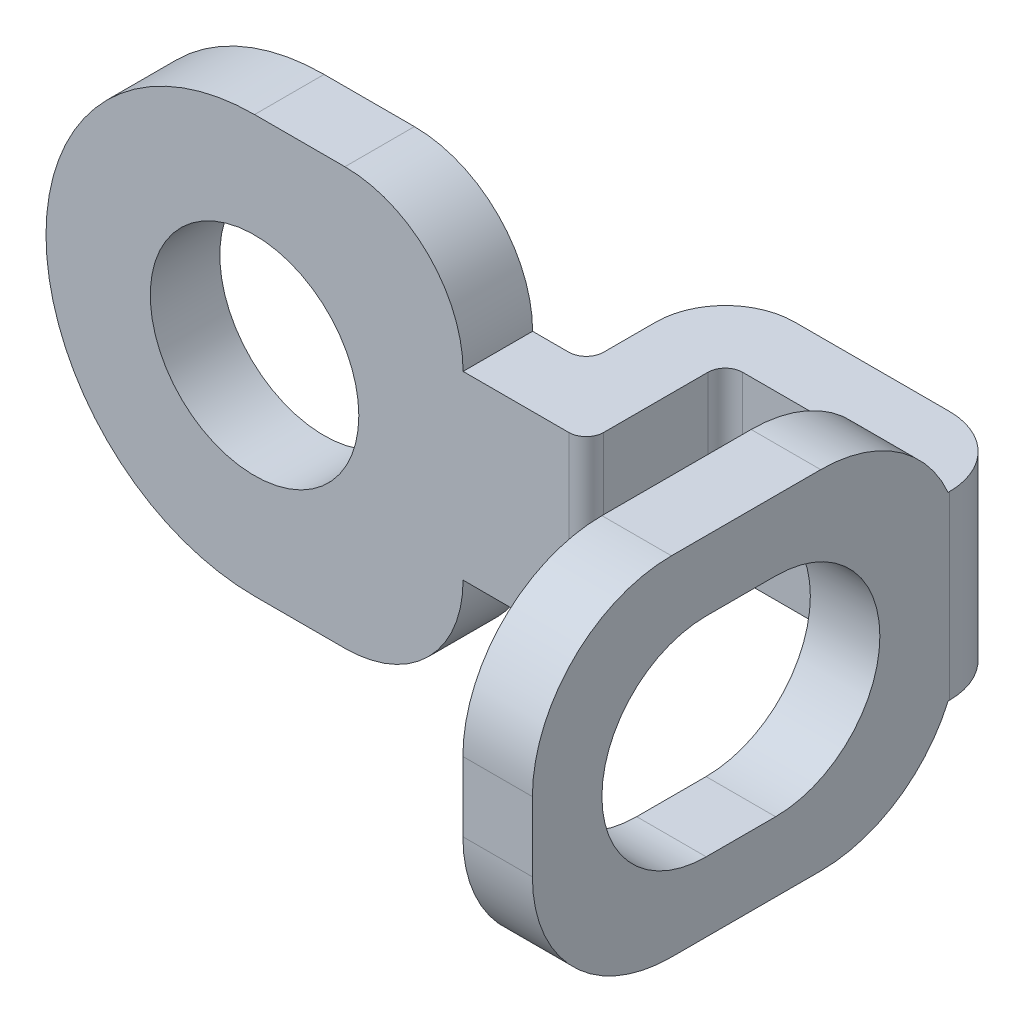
ISO-10303-21;
HEADER;
FILE_DESCRIPTION(('STEP AP214'),'2;1');
FILE_NAME('part.step','',(''),(''),'','','');
FILE_SCHEMA(('AUTOMOTIVE_DESIGN { 1 0 10303 214 1 1 1 1 }'));
ENDSEC;
DATA;
#1=APPLICATION_CONTEXT('core data for automotive mechanical design processes');
#2=APPLICATION_PROTOCOL_DEFINITION('international standard','automotive_design',2000,#1);
#3=PRODUCT_CONTEXT('',#1,'mechanical');
#4=PRODUCT('Part','Part','',(#3));
#5=PRODUCT_RELATED_PRODUCT_CATEGORY('part','',(#4));
#6=PRODUCT_DEFINITION_FORMATION('','',#4);
#7=PRODUCT_DEFINITION_CONTEXT('part definition',#1,'design');
#8=PRODUCT_DEFINITION('design','',#6,#7);
#9=PRODUCT_DEFINITION_SHAPE('','',#8);
#10=(LENGTH_UNIT() NAMED_UNIT(*) SI_UNIT(.MILLI.,.METRE.));
#11=(NAMED_UNIT(*) PLANE_ANGLE_UNIT() SI_UNIT($,.RADIAN.));
#12=(NAMED_UNIT(*) SI_UNIT($,.STERADIAN.) SOLID_ANGLE_UNIT());
#13=UNCERTAINTY_MEASURE_WITH_UNIT(LENGTH_MEASURE(1.E-05),#10,'distance_accuracy_value','');
#14=(GEOMETRIC_REPRESENTATION_CONTEXT(3) GLOBAL_UNCERTAINTY_ASSIGNED_CONTEXT((#13)) GLOBAL_UNIT_ASSIGNED_CONTEXT((#10,
#11,#12)) REPRESENTATION_CONTEXT('',''));
#15=CARTESIAN_POINT('',(0.,0.,0.));
#16=DIRECTION('',(0.,0.,1.));
#17=DIRECTION('',(1.,0.,0.));
#18=AXIS2_PLACEMENT_3D('',#15,#16,#17);
#19=CARTESIAN_POINT('',(4.1409794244,1.0795,-0.15875));
#20=DIRECTION('',(0.,1.,0.));
#21=DIRECTION('',(-1.,0.,0.));
#22=AXIS2_PLACEMENT_3D('',#19,#20,#21);
#23=CYLINDRICAL_SURFACE('',#22,0.15875);
#24=CARTESIAN_POINT('',(4.1409794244,2.7305,-0.15875));
#25=DIRECTION('',(0.,1.,0.));
#26=DIRECTION('',(-1.,0.,0.));
#27=AXIS2_PLACEMENT_3D('',#24,#25,#26);
#28=CIRCLE('',#27,0.15875);
#29=CARTESIAN_POINT('',(4.1409794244,2.730500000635,0.));
#30=VERTEX_POINT('',#29);
#31=CARTESIAN_POINT('',(4.2997294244,2.7305,-0.15875));
#32=VERTEX_POINT('',#31);
#33=EDGE_CURVE('E220',#30,#32,#28,.T.);
#34=ORIENTED_EDGE('',*,*,#33,.T.);
#35=DIRECTION('',(0.,-1.,0.));
#36=VECTOR('',#35,1.);
#37=CARTESIAN_POINT('',(4.2997294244,1.905,-0.15875));
#38=LINE('',#37,#36);
#39=CARTESIAN_POINT('',(4.2997294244,1.0795,-0.15875));
#40=VERTEX_POINT('',#39);
#41=EDGE_CURVE('E224',#32,#40,#38,.T.);
#42=ORIENTED_EDGE('',*,*,#41,.T.);
#43=CARTESIAN_POINT('',(4.1409794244,1.0795,-0.15875));
#44=DIRECTION('',(0.,1.,0.));
#45=DIRECTION('',(-1.,0.,0.));
#46=AXIS2_PLACEMENT_3D('',#43,#44,#45);
#47=CIRCLE('',#46,0.15875);
#48=CARTESIAN_POINT('',(4.1409794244,1.079499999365,0.));
#49=VERTEX_POINT('',#48);
#50=EDGE_CURVE('E19',#40,#49,#47,.F.);
#51=ORIENTED_EDGE('',*,*,#50,.T.);
#52=DIRECTION('',(0.,-1.,0.));
#53=VECTOR('',#52,1.);
#54=CARTESIAN_POINT('',(4.1409794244,1.905,0.));
#55=LINE('',#54,#53);
#56=EDGE_CURVE('E239',#30,#49,#55,.T.);
#57=ORIENTED_EDGE('',*,*,#56,.F.);
#58=EDGE_LOOP('',(#34,#42,#51,#57));
#59=FACE_BOUND('',#58,.T.);
#60=ADVANCED_FACE('F15',(#59),#23,.F.);
#61=CARTESIAN_POINT('',(4.1409794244,0.,0.));
#62=DIRECTION('',(0.,0.,-1.));
#63=DIRECTION('',(-1.,0.,0.));
#64=AXIS2_PLACEMENT_3D('',#61,#62,#63);
#65=PLANE('',#64);
#66=CARTESIAN_POINT('',(1.905,1.905,0.));
#67=DIRECTION('',(0.,0.,1.));
#68=DIRECTION('',(1.,0.,0.));
#69=AXIS2_PLACEMENT_3D('',#66,#67,#68);
#70=CIRCLE('',#69,0.9525);
#71=CARTESIAN_POINT('',(2.8575,1.905,0.));
#72=VERTEX_POINT('',#71);
#73=EDGE_CURVE('E504',#72,#72,#70,.F.);
#74=ORIENTED_EDGE('',*,*,#73,.F.);
#75=EDGE_LOOP('',(#74));
#76=FACE_BOUND('',#75,.T.);
#77=DIRECTION('',(1.,0.,0.));
#78=VECTOR('',#77,1.);
#79=CARTESIAN_POINT('',(2.31775,3.81,0.));
#80=LINE('',#79,#78);
#81=CARTESIAN_POINT('',(1.905,3.81,0.));
#82=VERTEX_POINT('',#81);
#83=CARTESIAN_POINT('',(2.7305000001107,3.81,0.));
#84=VERTEX_POINT('',#83);
#85=EDGE_CURVE('E509',#82,#84,#80,.T.);
#86=ORIENTED_EDGE('',*,*,#85,.T.);
#87=CARTESIAN_POINT('',(2.7305,2.7305,0.));
#88=DIRECTION('',(0.,0.,-1.));
#89=DIRECTION('',(-1.,0.,0.));
#90=AXIS2_PLACEMENT_3D('',#87,#88,#89);
#91=CIRCLE('',#90,1.0795);
#92=CARTESIAN_POINT('',(3.81,2.73050000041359,0.));
#93=VERTEX_POINT('',#92);
#94=EDGE_CURVE('E505',#84,#93,#91,.T.);
#95=ORIENTED_EDGE('',*,*,#94,.T.);
#96=DIRECTION('',(1.,0.,0.));
#97=VECTOR('',#96,1.);
#98=CARTESIAN_POINT('',(2.0580667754,2.73050000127,0.));
#99=LINE('',#98,#97);
#100=EDGE_CURVE('E241',#93,#30,#99,.T.);
#101=ORIENTED_EDGE('',*,*,#100,.T.);
#102=ORIENTED_EDGE('',*,*,#56,.T.);
#103=DIRECTION('',(-1.,0.,0.));
#104=VECTOR('',#103,1.);
#105=CARTESIAN_POINT('',(2.0580667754,1.07949999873,0.));
#106=LINE('',#105,#104);
#107=CARTESIAN_POINT('',(3.81,1.07949999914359,0.));
#108=VERTEX_POINT('',#107);
#109=EDGE_CURVE('E215',#49,#108,#106,.T.);
#110=ORIENTED_EDGE('',*,*,#109,.T.);
#111=CARTESIAN_POINT('',(2.7305,1.0795,0.));
#112=DIRECTION('',(0.,0.,-1.));
#113=DIRECTION('',(-1.,0.,0.));
#114=AXIS2_PLACEMENT_3D('',#111,#112,#113);
#115=CIRCLE('',#114,1.0795);
#116=CARTESIAN_POINT('',(2.7305,0.,0.));
#117=VERTEX_POINT('',#116);
#118=EDGE_CURVE('E520',#108,#117,#115,.T.);
#119=ORIENTED_EDGE('',*,*,#118,.T.);
#120=DIRECTION('',(-1.,0.,0.));
#121=VECTOR('',#120,1.);
#122=CARTESIAN_POINT('',(2.31775,0.,0.));
#123=LINE('',#122,#121);
#124=CARTESIAN_POINT('',(1.90500000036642,0.,0.));
#125=VERTEX_POINT('',#124);
#126=EDGE_CURVE('E237',#117,#125,#123,.T.);
#127=ORIENTED_EDGE('',*,*,#126,.T.);
#128=CARTESIAN_POINT('',(1.905,1.905,0.));
#129=DIRECTION('',(0.,0.,-1.));
#130=DIRECTION('',(-1.,0.,0.));
#131=AXIS2_PLACEMENT_3D('',#128,#129,#130);
#132=CIRCLE('',#131,1.905);
#133=EDGE_CURVE('E513',#125,#82,#132,.T.);
#134=ORIENTED_EDGE('',*,*,#133,.T.);
#135=EDGE_LOOP('',(#86,#95,#101,#102,#110,#119,#127,#134));
#136=FACE_BOUND('',#135,.T.);
#137=ADVANCED_FACE('F377',(#76,#136),#65,.T.);
#138=CARTESIAN_POINT('',(4.2997294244,1.0795,-0.15875));
#139=DIRECTION('',(1.,0.,0.));
#140=DIRECTION('',(0.,0.,-1.));
#141=AXIS2_PLACEMENT_3D('',#138,#139,#140);
#142=PLANE('',#141);
#143=ORIENTED_EDGE('',*,*,#41,.F.);
#144=DIRECTION('',(0.,0.,1.));
#145=VECTOR('',#144,1.);
#146=CARTESIAN_POINT('',(4.2997294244,2.7305,-0.396875));
#147=LINE('',#146,#145);
#148=CARTESIAN_POINT('',(4.2997294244,2.7305,-0.635000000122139));
#149=VERTEX_POINT('',#148);
#150=EDGE_CURVE('E232',#149,#32,#147,.T.);
#151=ORIENTED_EDGE('',*,*,#150,.F.);
#152=DIRECTION('',(0.,1.,0.));
#153=VECTOR('',#152,1.);
#154=CARTESIAN_POINT('',(4.2997294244,1.905,-0.635000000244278));
#155=LINE('',#154,#153);
#156=CARTESIAN_POINT('',(4.2997294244,1.0795,-0.635000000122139));
#157=VERTEX_POINT('',#156);
#158=EDGE_CURVE('E227',#149,#157,#155,.F.);
#159=ORIENTED_EDGE('',*,*,#158,.T.);
#160=DIRECTION('',(0.,0.,-1.));
#161=VECTOR('',#160,1.);
#162=CARTESIAN_POINT('',(4.2997294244,1.0795,-0.396875));
#163=LINE('',#162,#161);
#164=EDGE_CURVE('E212',#40,#157,#163,.T.);
#165=ORIENTED_EDGE('',*,*,#164,.F.);
#166=EDGE_LOOP('',(#143,#151,#159,#165));
#167=FACE_BOUND('',#166,.T.);
#168=ADVANCED_FACE('F223',(#167),#142,.F.);
#169=CARTESIAN_POINT('',(2.7305,1.0795,0.635));
#170=DIRECTION('',(0.,0.,-1.));
#171=DIRECTION('',(-1.,0.,0.));
#172=AXIS2_PLACEMENT_3D('',#169,#170,#171);
#173=CYLINDRICAL_SURFACE('',#172,1.0795);
#174=DIRECTION('',(0.,0.,-1.));
#175=VECTOR('',#174,1.);
#176=CARTESIAN_POINT('',(2.7305,0.,0.3175));
#177=LINE('',#176,#175);
#178=CARTESIAN_POINT('',(2.7305,0.,0.635));
#179=VERTEX_POINT('',#178);
#180=EDGE_CURVE('E517',#179,#117,#177,.T.);
#181=ORIENTED_EDGE('',*,*,#180,.T.);
#182=ORIENTED_EDGE('',*,*,#118,.F.);
#183=DIRECTION('',(0.,0.,1.));
#184=VECTOR('',#183,1.);
#185=CARTESIAN_POINT('',(3.81,1.07949999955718,0.3175));
#186=LINE('',#185,#184);
#187=CARTESIAN_POINT('',(3.81,1.07949999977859,0.635));
#188=VERTEX_POINT('',#187);
#189=EDGE_CURVE('E229',#188,#108,#186,.F.);
#190=ORIENTED_EDGE('',*,*,#189,.F.);
#191=CARTESIAN_POINT('',(2.7305,1.0795,0.635));
#192=DIRECTION('',(0.,0.,-1.));
#193=DIRECTION('',(-1.,0.,0.));
#194=AXIS2_PLACEMENT_3D('',#191,#192,#193);
#195=CIRCLE('',#194,1.0795);
#196=EDGE_CURVE('E495',#188,#179,#195,.T.);
#197=ORIENTED_EDGE('',*,*,#196,.T.);
#198=EDGE_LOOP('',(#181,#182,#190,#197));
#199=FACE_BOUND('',#198,.T.);
#200=ADVANCED_FACE('F371',(#199),#173,.T.);
#201=CARTESIAN_POINT('',(1.905,0.,0.));
#202=DIRECTION('',(0.,1.,0.));
#203=DIRECTION('',(0.,0.,1.));
#204=AXIS2_PLACEMENT_3D('',#201,#202,#203);
#205=PLANE('',#204);
#206=ORIENTED_EDGE('',*,*,#180,.F.);
#207=DIRECTION('',(-1.,0.,0.));
#208=VECTOR('',#207,1.);
#209=CARTESIAN_POINT('',(2.3736617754,0.,0.635));
#210=LINE('',#209,#208);
#211=CARTESIAN_POINT('',(1.90500000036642,0.,0.635));
#212=VERTEX_POINT('',#211);
#213=EDGE_CURVE('E492',#179,#212,#210,.T.);
#214=ORIENTED_EDGE('',*,*,#213,.T.);
#215=DIRECTION('',(0.,0.,1.));
#216=VECTOR('',#215,1.);
#217=CARTESIAN_POINT('',(1.90500000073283,0.,0.3175));
#218=LINE('',#217,#216);
#219=EDGE_CURVE('E514',#212,#125,#218,.F.);
#220=ORIENTED_EDGE('',*,*,#219,.T.);
#221=ORIENTED_EDGE('',*,*,#126,.F.);
#222=EDGE_LOOP('',(#206,#214,#220,#221));
#223=FACE_BOUND('',#222,.T.);
#224=ADVANCED_FACE('F369',(#223),#205,.F.);
#225=CARTESIAN_POINT('',(1.905,1.905,0.635));
#226=DIRECTION('',(0.,0.,-1.));
#227=DIRECTION('',(-1.,0.,0.));
#228=AXIS2_PLACEMENT_3D('',#225,#226,#227);
#229=CYLINDRICAL_SURFACE('',#228,1.905);
#230=DIRECTION('',(0.,0.,-1.));
#231=VECTOR('',#230,1.);
#232=CARTESIAN_POINT('',(1.905,3.81,0.3175));
#233=LINE('',#232,#231);
#234=CARTESIAN_POINT('',(1.905,3.81,0.635));
#235=VERTEX_POINT('',#234);
#236=EDGE_CURVE('E510',#235,#82,#233,.T.);
#237=ORIENTED_EDGE('',*,*,#236,.T.);
#238=ORIENTED_EDGE('',*,*,#133,.F.);
#239=ORIENTED_EDGE('',*,*,#219,.F.);
#240=CARTESIAN_POINT('',(1.905,1.905,0.635));
#241=DIRECTION('',(0.,0.,-1.));
#242=DIRECTION('',(-1.,0.,0.));
#243=AXIS2_PLACEMENT_3D('',#240,#241,#242);
#244=CIRCLE('',#243,1.905);
#245=EDGE_CURVE('E491',#212,#235,#244,.T.);
#246=ORIENTED_EDGE('',*,*,#245,.T.);
#247=EDGE_LOOP('',(#237,#238,#239,#246));
#248=FACE_BOUND('',#247,.T.);
#249=ADVANCED_FACE('F366',(#248),#229,.T.);
#250=CARTESIAN_POINT('',(1.905,3.81,0.635));
#251=DIRECTION('',(0.,-1.,0.));
#252=DIRECTION('',(0.,0.,-1.));
#253=AXIS2_PLACEMENT_3D('',#250,#251,#252);
#254=PLANE('',#253);
#255=DIRECTION('',(0.,0.,1.));
#256=VECTOR('',#255,1.);
#257=CARTESIAN_POINT('',(2.73050000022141,3.81,0.3175));
#258=LINE('',#257,#256);
#259=CARTESIAN_POINT('',(2.7305000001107,3.81,0.635));
#260=VERTEX_POINT('',#259);
#261=EDGE_CURVE('E506',#260,#84,#258,.F.);
#262=ORIENTED_EDGE('',*,*,#261,.T.);
#263=ORIENTED_EDGE('',*,*,#85,.F.);
#264=ORIENTED_EDGE('',*,*,#236,.F.);
#265=DIRECTION('',(1.,0.,0.));
#266=VECTOR('',#265,1.);
#267=CARTESIAN_POINT('',(2.3736617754,3.81,0.635));
#268=LINE('',#267,#266);
#269=EDGE_CURVE('E487',#235,#260,#268,.T.);
#270=ORIENTED_EDGE('',*,*,#269,.T.);
#271=EDGE_LOOP('',(#262,#263,#264,#270));
#272=FACE_BOUND('',#271,.T.);
#273=ADVANCED_FACE('F364',(#272),#254,.F.);
#274=CARTESIAN_POINT('',(2.7305,2.7305,0.635));
#275=DIRECTION('',(0.,0.,-1.));
#276=DIRECTION('',(-1.,0.,0.));
#277=AXIS2_PLACEMENT_3D('',#274,#275,#276);
#278=CYLINDRICAL_SURFACE('',#277,1.0795);
#279=DIRECTION('',(0.,0.,-1.));
#280=VECTOR('',#279,1.);
#281=CARTESIAN_POINT('',(3.81,2.73049999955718,0.3175));
#282=LINE('',#281,#280);
#283=CARTESIAN_POINT('',(3.81,2.73049999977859,0.635));
#284=VERTEX_POINT('',#283);
#285=EDGE_CURVE('E502',#93,#284,#282,.F.);
#286=ORIENTED_EDGE('',*,*,#285,.F.);
#287=ORIENTED_EDGE('',*,*,#94,.F.);
#288=ORIENTED_EDGE('',*,*,#261,.F.);
#289=CARTESIAN_POINT('',(2.7305,2.7305,0.635));
#290=DIRECTION('',(0.,0.,-1.));
#291=DIRECTION('',(-1.,0.,0.));
#292=AXIS2_PLACEMENT_3D('',#289,#290,#291);
#293=CIRCLE('',#292,1.0795);
#294=EDGE_CURVE('E490',#260,#284,#293,.T.);
#295=ORIENTED_EDGE('',*,*,#294,.T.);
#296=EDGE_LOOP('',(#286,#287,#288,#295));
#297=FACE_BOUND('',#296,.T.);
#298=ADVANCED_FACE('F360',(#297),#278,.T.);
#299=CARTESIAN_POINT('',(1.905,1.905,0.));
#300=DIRECTION('',(0.,0.,1.));
#301=DIRECTION('',(1.,0.,0.));
#302=AXIS2_PLACEMENT_3D('',#299,#300,#301);
#303=CYLINDRICAL_SURFACE('',#302,0.9525);
#304=ORIENTED_EDGE('',*,*,#73,.T.);
#305=EDGE_LOOP('',(#304));
#306=FACE_BOUND('',#305,.T.);
#307=CARTESIAN_POINT('',(1.905,1.905,0.635));
#308=DIRECTION('',(0.,0.,1.));
#309=DIRECTION('',(1.,0.,0.));
#310=AXIS2_PLACEMENT_3D('',#307,#308,#309);
#311=CIRCLE('',#310,0.9525);
#312=CARTESIAN_POINT('',(2.8575,1.905,0.635));
#313=VERTEX_POINT('',#312);
#314=EDGE_CURVE('E484',#313,#313,#311,.T.);
#315=ORIENTED_EDGE('',*,*,#314,.T.);
#316=EDGE_LOOP('',(#315));
#317=FACE_BOUND('',#316,.T.);
#318=ADVANCED_FACE('F356',(#306,#317),#303,.F.);
#319=CARTESIAN_POINT('',(4.7759794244,1.0795,0.47625));
#320=DIRECTION('',(0.,1.,0.));
#321=DIRECTION('',(-1.,0.,0.));
#322=AXIS2_PLACEMENT_3D('',#319,#320,#321);
#323=CYLINDRICAL_SURFACE('',#322,0.15875);
#324=DIRECTION('',(0.,1.,0.));
#325=VECTOR('',#324,1.);
#326=CARTESIAN_POINT('',(4.9347294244,1.905,0.47625));
#327=LINE('',#326,#325);
#328=CARTESIAN_POINT('',(4.93472942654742,1.0795,0.47625));
#329=VERTEX_POINT('',#328);
#330=CARTESIAN_POINT('',(4.93472942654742,2.7305,0.47625));
#331=VERTEX_POINT('',#330);
#332=EDGE_CURVE('E481',#329,#331,#327,.T.);
#333=ORIENTED_EDGE('',*,*,#332,.T.);
#334=CARTESIAN_POINT('',(4.7759794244,2.7305,0.47625));
#335=DIRECTION('',(0.,1.,0.));
#336=DIRECTION('',(-1.,0.,0.));
#337=AXIS2_PLACEMENT_3D('',#334,#335,#336);
#338=CIRCLE('',#337,0.15875);
#339=CARTESIAN_POINT('',(4.7759794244,2.7305,0.635));
#340=VERTEX_POINT('',#339);
#341=EDGE_CURVE('E549',#340,#331,#338,.T.);
#342=ORIENTED_EDGE('',*,*,#341,.F.);
#343=DIRECTION('',(0.,-1.,0.));
#344=VECTOR('',#343,1.);
#345=CARTESIAN_POINT('',(4.7759794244,1.905,0.635));
#346=LINE('',#345,#344);
#347=CARTESIAN_POINT('',(4.7759794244,1.0795,0.635));
#348=VERTEX_POINT('',#347);
#349=EDGE_CURVE('E496',#340,#348,#346,.T.);
#350=ORIENTED_EDGE('',*,*,#349,.T.);
#351=CARTESIAN_POINT('',(4.7759794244,1.0795,0.47625));
#352=DIRECTION('',(0.,1.,0.));
#353=DIRECTION('',(-1.,0.,0.));
#354=AXIS2_PLACEMENT_3D('',#351,#352,#353);
#355=CIRCLE('',#354,0.15875);
#356=EDGE_CURVE('E547',#329,#348,#355,.F.);
#357=ORIENTED_EDGE('',*,*,#356,.F.);
#358=EDGE_LOOP('',(#333,#342,#350,#357));
#359=FACE_BOUND('',#358,.T.);
#360=ADVANCED_FACE('F352',(#359),#323,.T.);
#361=CARTESIAN_POINT('',(5.0934794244,2.7305,-0.47625));
#362=DIRECTION('',(0.,-1.,0.));
#363=DIRECTION('',(0.,0.,-1.));
#364=AXIS2_PLACEMENT_3D('',#361,#362,#363);
#365=CYLINDRICAL_SURFACE('',#364,0.15875);
#366=CARTESIAN_POINT('',(5.0934794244,2.7305,-0.47625));
#367=DIRECTION('',(0.,-1.,0.));
#368=DIRECTION('',(0.,0.,-1.));
#369=AXIS2_PLACEMENT_3D('',#366,#367,#368);
#370=CIRCLE('',#369,0.15875);
#371=CARTESIAN_POINT('',(5.0934794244,2.7305,-0.6350000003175));
#372=VERTEX_POINT('',#371);
#373=CARTESIAN_POINT('',(4.93472942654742,2.7305,-0.47625));
#374=VERTEX_POINT('',#373);
#375=EDGE_CURVE('E500',#372,#374,#370,.F.);
#376=ORIENTED_EDGE('',*,*,#375,.T.);
#377=DIRECTION('',(0.,-1.,0.));
#378=VECTOR('',#377,1.);
#379=CARTESIAN_POINT('',(4.9347294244,1.905,-0.47625));
#380=LINE('',#379,#378);
#381=CARTESIAN_POINT('',(4.93472942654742,1.0795,-0.47625));
#382=VERTEX_POINT('',#381);
#383=EDGE_CURVE('E480',#374,#382,#380,.T.);
#384=ORIENTED_EDGE('',*,*,#383,.T.);
#385=CARTESIAN_POINT('',(5.0934794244,1.0795,-0.47625));
#386=DIRECTION('',(0.,-1.,0.));
#387=DIRECTION('',(0.,0.,-1.));
#388=AXIS2_PLACEMENT_3D('',#385,#386,#387);
#389=CIRCLE('',#388,0.15875);
#390=CARTESIAN_POINT('',(5.0934794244,1.0795,-0.6350000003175));
#391=VERTEX_POINT('',#390);
#392=EDGE_CURVE('E545',#382,#391,#389,.T.);
#393=ORIENTED_EDGE('',*,*,#392,.T.);
#394=DIRECTION('',(0.,1.,0.));
#395=VECTOR('',#394,1.);
#396=CARTESIAN_POINT('',(5.0934794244,1.905,-0.635));
#397=LINE('',#396,#395);
#398=EDGE_CURVE('E477',#391,#372,#397,.T.);
#399=ORIENTED_EDGE('',*,*,#398,.T.);
#400=EDGE_LOOP('',(#376,#384,#393,#399));
#401=FACE_BOUND('',#400,.T.);
#402=ADVANCED_FACE('F348',(#401),#365,.F.);
#403=CARTESIAN_POINT('',(4.9347294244,1.0795,-0.635));
#404=DIRECTION('',(0.,1.,0.));
#405=DIRECTION('',(-1.,0.,0.));
#406=AXIS2_PLACEMENT_3D('',#403,#404,#405);
#407=CYLINDRICAL_SURFACE('',#406,0.635);
#408=DIRECTION('',(0.,-1.,0.));
#409=VECTOR('',#408,1.);
#410=CARTESIAN_POINT('',(4.9347294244,1.905,-1.27));
#411=LINE('',#410,#409);
#412=CARTESIAN_POINT('',(4.9347294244,2.7305,-1.27));
#413=VERTEX_POINT('',#412);
#414=CARTESIAN_POINT('',(4.9347294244,1.0795,-1.27));
#415=VERTEX_POINT('',#414);
#416=EDGE_CURVE('E476',#413,#415,#411,.T.);
#417=ORIENTED_EDGE('',*,*,#416,.T.);
#418=CARTESIAN_POINT('',(4.9347294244,1.0795,-0.635));
#419=DIRECTION('',(0.,1.,0.));
#420=DIRECTION('',(-1.,0.,0.));
#421=AXIS2_PLACEMENT_3D('',#418,#419,#420);
#422=CIRCLE('',#421,0.635);
#423=EDGE_CURVE('E306',#415,#157,#422,.T.);
#424=ORIENTED_EDGE('',*,*,#423,.T.);
#425=ORIENTED_EDGE('',*,*,#158,.F.);
#426=CARTESIAN_POINT('',(4.9347294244,2.7305,-0.635));
#427=DIRECTION('',(0.,1.,0.));
#428=DIRECTION('',(-1.,0.,0.));
#429=AXIS2_PLACEMENT_3D('',#426,#427,#428);
#430=CIRCLE('',#429,0.635);
#431=EDGE_CURVE('E314',#413,#149,#430,.T.);
#432=ORIENTED_EDGE('',*,*,#431,.F.);
#433=EDGE_LOOP('',(#417,#424,#425,#432));
#434=FACE_BOUND('',#433,.T.);
#435=ADVANCED_FACE('F343',(#434),#407,.T.);
#436=CARTESIAN_POINT('',(4.7759794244,0.,0.635));
#437=DIRECTION('',(0.,0.,-1.));
#438=DIRECTION('',(-1.,0.,0.));
#439=AXIS2_PLACEMENT_3D('',#436,#437,#438);
#440=PLANE('',#439);
#441=ORIENTED_EDGE('',*,*,#314,.F.);
#442=EDGE_LOOP('',(#441));
#443=FACE_BOUND('',#442,.T.);
#444=ORIENTED_EDGE('',*,*,#349,.F.);
#445=DIRECTION('',(1.,0.,0.));
#446=VECTOR('',#445,1.);
#447=CARTESIAN_POINT('',(5.3959969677,2.7305,0.635));
#448=LINE('',#447,#446);
#449=EDGE_CURVE('E317',#284,#340,#448,.T.);
#450=ORIENTED_EDGE('',*,*,#449,.F.);
#451=ORIENTED_EDGE('',*,*,#294,.F.);
#452=ORIENTED_EDGE('',*,*,#269,.F.);
#453=ORIENTED_EDGE('',*,*,#245,.F.);
#454=ORIENTED_EDGE('',*,*,#213,.F.);
#455=ORIENTED_EDGE('',*,*,#196,.F.);
#456=DIRECTION('',(1.,0.,0.));
#457=VECTOR('',#456,1.);
#458=CARTESIAN_POINT('',(5.3959969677,1.0795,0.635));
#459=LINE('',#458,#457);
#460=EDGE_CURVE('E308',#188,#348,#459,.T.);
#461=ORIENTED_EDGE('',*,*,#460,.T.);
#462=EDGE_LOOP('',(#444,#450,#451,#452,#453,#454,#455,#461));
#463=FACE_BOUND('',#462,.T.);
#464=ADVANCED_FACE('F347',(#443,#463),#440,.F.);
#465=CARTESIAN_POINT('',(4.9347294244,1.0795,-0.47625));
#466=DIRECTION('',(-1.,0.,0.));
#467=DIRECTION('',(0.,0.,1.));
#468=AXIS2_PLACEMENT_3D('',#465,#466,#467);
#469=PLANE('',#468);
#470=ORIENTED_EDGE('',*,*,#383,.F.);
#471=DIRECTION('',(0.,0.,-1.));
#472=VECTOR('',#471,1.);
#473=CARTESIAN_POINT('',(4.93472942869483,2.7305,-0.3175));
#474=LINE('',#473,#472);
#475=EDGE_CURVE('E569',#331,#374,#474,.T.);
#476=ORIENTED_EDGE('',*,*,#475,.F.);
#477=ORIENTED_EDGE('',*,*,#332,.F.);
#478=DIRECTION('',(0.,0.,-1.));
#479=VECTOR('',#478,1.);
#480=CARTESIAN_POINT('',(4.93472942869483,1.0795,-0.3175));
#481=LINE('',#480,#479);
#482=EDGE_CURVE('E560',#329,#382,#481,.T.);
#483=ORIENTED_EDGE('',*,*,#482,.T.);
#484=EDGE_LOOP('',(#470,#476,#477,#483));
#485=FACE_BOUND('',#484,.T.);
#486=ADVANCED_FACE('F391',(#485),#469,.F.);
#487=CARTESIAN_POINT('',(6.1882439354,1.0795,-0.635));
#488=DIRECTION('',(0.,0.,-1.));
#489=DIRECTION('',(-1.,0.,0.));
#490=AXIS2_PLACEMENT_3D('',#487,#488,#489);
#491=PLANE('',#490);
#492=DIRECTION('',(0.,1.,0.));
#493=VECTOR('',#492,1.);
#494=CARTESIAN_POINT('',(6.1882439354,1.905,-0.635));
#495=LINE('',#494,#493);
#496=CARTESIAN_POINT('',(6.1882439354,2.73049999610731,-0.63500000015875));
#497=VERTEX_POINT('',#496);
#498=CARTESIAN_POINT('',(6.1882439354,1.07950000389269,-0.63500000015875));
#499=VERTEX_POINT('',#498);
#500=EDGE_CURVE('E326',#497,#499,#495,.F.);
#501=ORIENTED_EDGE('',*,*,#500,.F.);
#502=DIRECTION('',(1.,0.,0.));
#503=VECTOR('',#502,1.);
#504=CARTESIAN_POINT('',(5.3959969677,2.7305,-0.635000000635));
#505=LINE('',#504,#503);
#506=EDGE_CURVE('E313',#372,#497,#505,.T.);
#507=ORIENTED_EDGE('',*,*,#506,.F.);
#508=ORIENTED_EDGE('',*,*,#398,.F.);
#509=DIRECTION('',(1.,0.,0.));
#510=VECTOR('',#509,1.);
#511=CARTESIAN_POINT('',(5.3959969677,1.0795,-0.635000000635));
#512=LINE('',#511,#510);
#513=EDGE_CURVE('E305',#391,#499,#512,.T.);
#514=ORIENTED_EDGE('',*,*,#513,.T.);
#515=EDGE_LOOP('',(#501,#507,#508,#514));
#516=FACE_BOUND('',#515,.T.);
#517=ADVANCED_FACE('F341',(#516),#491,.F.);
#518=CARTESIAN_POINT('',(6.1882439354,2.9962480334,-0.47625));
#519=DIRECTION('',(0.,-1.,0.));
#520=DIRECTION('',(1.,0.,0.));
#521=AXIS2_PLACEMENT_3D('',#518,#519,#520);
#522=CYLINDRICAL_SURFACE('',#521,0.15875);
#523=ORIENTED_EDGE('',*,*,#500,.T.);
#524=CARTESIAN_POINT('',(6.1882439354,1.07950000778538,-0.47625));
#525=DIRECTION('',(0.,-1.,0.));
#526=DIRECTION('',(1.,0.,0.));
#527=AXIS2_PLACEMENT_3D('',#524,#525,#526);
#528=CIRCLE('',#527,0.15875);
#529=CARTESIAN_POINT('',(6.24798147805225,1.07950000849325,-0.623331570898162));
#530=VERTEX_POINT('',#529);
#531=EDGE_CURVE('E301',#499,#530,#528,.T.);
#532=ORIENTED_EDGE('',*,*,#531,.T.);
#533=CARTESIAN_POINT('',(6.24798147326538,1.07950000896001,-0.623331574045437));
#534=CARTESIAN_POINT('',(6.25273383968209,1.07505808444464,-0.621394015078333));
#535=CARTESIAN_POINT('',(6.25719012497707,1.07038472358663,-0.619323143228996));
#536=CARTESIAN_POINT('',(6.26559185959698,1.0607178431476,-0.614964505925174));
#537=CARTESIAN_POINT('',(6.26953885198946,1.05572536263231,-0.612677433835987));
#538=CARTESIAN_POINT('',(6.28074809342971,1.04047877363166,-0.605565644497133));
#539=CARTESIAN_POINT('',(6.28741498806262,1.02991804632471,-0.600474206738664));
#540=CARTESIAN_POINT('',(6.30504917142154,0.998733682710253,-0.584868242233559));
#541=CARTESIAN_POINT('',(6.31447147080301,0.97762524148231,-0.573604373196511));
#542=CARTESIAN_POINT('',(6.32994142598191,0.9350970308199,-0.549255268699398));
#543=CARTESIAN_POINT('',(6.33597123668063,0.913676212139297,-0.536160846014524));
#544=CARTESIAN_POINT('',(6.34238454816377,0.881285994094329,-0.514979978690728));
#545=CARTESIAN_POINT('',(6.34408951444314,0.870191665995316,-0.507473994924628));
#546=CARTESIAN_POINT('',(6.34638631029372,0.848256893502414,-0.492119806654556));
#547=CARTESIAN_POINT('',(6.34698673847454,0.837415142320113,-0.48427473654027));
#548=CARTESIAN_POINT('',(6.3469939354,0.826691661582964,-0.476249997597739));
#549=B_SPLINE_CURVE_WITH_KNOTS('',3,(#533,#534,#535,#536,#537,#538,#539,#540,#541,#542,#543,
#544,#545,#546,#547,#548),.UNSPECIFIED.,.F.,.F.,(4,2,2,2,2,2,2,4),(0.,0.0203247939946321,
0.0405864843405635,0.0809477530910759,0.157713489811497,0.234879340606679,0.275341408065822,
0.315487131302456),.UNSPECIFIED.);
#550=CARTESIAN_POINT('',(6.34699394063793,0.826691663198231,-0.476249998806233));
#551=VERTEX_POINT('',#550);
#552=EDGE_CURVE('E327',#530,#551,#549,.T.);
#553=ORIENTED_EDGE('',*,*,#552,.T.);
#554=DIRECTION('',(0.,1.,0.));
#555=VECTOR('',#554,1.);
#556=CARTESIAN_POINT('',(6.3469939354,1.905,-0.47625));
#557=LINE('',#556,#555);
#558=CARTESIAN_POINT('',(6.34699394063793,2.98330833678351,-0.476249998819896));
#559=VERTEX_POINT('',#558);
#560=EDGE_CURVE('E614',#551,#559,#557,.T.);
#561=ORIENTED_EDGE('',*,*,#560,.T.);
#562=CARTESIAN_POINT('',(6.3469939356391,2.98330833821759,-0.476249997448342));
#563=CARTESIAN_POINT('',(6.34698882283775,2.97309068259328,-0.483895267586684));
#564=CARTESIAN_POINT('',(6.34644289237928,2.96276876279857,-0.491376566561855));
#565=CARTESIAN_POINT('',(6.34436042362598,2.94197461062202,-0.505979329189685));
#566=CARTESIAN_POINT('',(6.34282417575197,2.93150242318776,-0.513100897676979));
#567=CARTESIAN_POINT('',(6.33679796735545,2.89957877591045,-0.534121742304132));
#568=CARTESIAN_POINT('',(6.33089640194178,2.87797331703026,-0.5474134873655));
#569=CARTESIAN_POINT('',(6.31770955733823,2.84100165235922,-0.568716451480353));
#570=CARTESIAN_POINT('',(6.31126840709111,2.82557485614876,-0.57716689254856));
#571=CARTESIAN_POINT('',(6.29637728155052,2.79527847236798,-0.592984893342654));
#572=CARTESIAN_POINT('',(6.2879444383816,2.78040532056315,-0.600360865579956));
#573=CARTESIAN_POINT('',(6.27377013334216,2.75985525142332,-0.610095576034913));
#574=CARTESIAN_POINT('',(6.26913937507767,2.75366329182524,-0.612963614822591));
#575=CARTESIAN_POINT('',(6.25914779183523,2.74170285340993,-0.618396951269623));
#576=CARTESIAN_POINT('',(6.25378352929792,2.73593657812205,-0.620960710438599));
#577=CARTESIAN_POINT('',(6.2479814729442,2.73049999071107,-0.623331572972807));
#578=B_SPLINE_CURVE_WITH_KNOTS('',3,(#562,#563,#564,#565,#566,#567,#568,#569,#570,#571,#572,
#573,#574,#575,#576,#577),.UNSPECIFIED.,.F.,.F.,(4,2,2,2,2,2,2,4),(0.,0.0382461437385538,
0.0764810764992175,0.154258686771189,0.210358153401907,0.265991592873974,0.290691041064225,
0.315510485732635),.UNSPECIFIED.);
#579=CARTESIAN_POINT('',(6.24798147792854,2.73049999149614,-0.623331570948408));
#580=VERTEX_POINT('',#579);
#581=EDGE_CURVE('E319',#559,#580,#578,.T.);
#582=ORIENTED_EDGE('',*,*,#581,.T.);
#583=CARTESIAN_POINT('',(6.1882439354,2.73049999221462,-0.47625));
#584=DIRECTION('',(0.,-1.,0.));
#585=DIRECTION('',(1.,0.,0.));
#586=AXIS2_PLACEMENT_3D('',#583,#584,#585);
#587=CIRCLE('',#586,0.15875);
#588=EDGE_CURVE('E310',#497,#580,#587,.T.);
#589=ORIENTED_EDGE('',*,*,#588,.F.);
#590=EDGE_LOOP('',(#523,#532,#553,#561,#582,#589));
#591=FACE_BOUND('',#590,.T.);
#592=ADVANCED_FACE('F336',(#591),#522,.F.);
#593=CARTESIAN_POINT('',(4.9347294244,1.0795,-1.27));
#594=DIRECTION('',(0.,0.,1.));
#595=DIRECTION('',(1.,0.,0.));
#596=AXIS2_PLACEMENT_3D('',#593,#594,#595);
#597=PLANE('',#596);
#598=DIRECTION('',(0.,1.,0.));
#599=VECTOR('',#598,1.);
#600=CARTESIAN_POINT('',(6.34699393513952,1.905,-1.27));
#601=LINE('',#600,#599);
#602=CARTESIAN_POINT('',(6.34699393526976,2.7305,-1.27));
#603=VERTEX_POINT('',#602);
#604=CARTESIAN_POINT('',(6.34699393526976,1.0795,-1.27));
#605=VERTEX_POINT('',#604);
#606=EDGE_CURVE('E291',#603,#605,#601,.F.);
#607=ORIENTED_EDGE('',*,*,#606,.T.);
#608=DIRECTION('',(-1.,0.,0.));
#609=VECTOR('',#608,1.);
#610=CARTESIAN_POINT('',(5.3959969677,1.0795,-1.27));
#611=LINE('',#610,#609);
#612=EDGE_CURVE('E309',#605,#415,#611,.T.);
#613=ORIENTED_EDGE('',*,*,#612,.T.);
#614=ORIENTED_EDGE('',*,*,#416,.F.);
#615=DIRECTION('',(-1.,0.,0.));
#616=VECTOR('',#615,1.);
#617=CARTESIAN_POINT('',(5.3959969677,2.7305,-1.27));
#618=LINE('',#617,#616);
#619=EDGE_CURVE('E318',#603,#413,#618,.T.);
#620=ORIENTED_EDGE('',*,*,#619,.F.);
#621=EDGE_LOOP('',(#607,#613,#614,#620));
#622=FACE_BOUND('',#621,.T.);
#623=ADVANCED_FACE('F340',(#622),#597,.F.);
#624=CARTESIAN_POINT('',(3.81,2.7305,-1.27));
#625=DIRECTION('',(0.,1.,0.));
#626=DIRECTION('',(0.,0.,1.));
#627=AXIS2_PLACEMENT_3D('',#624,#625,#626);
#628=PLANE('',#627);
#629=ORIENTED_EDGE('',*,*,#506,.T.);
#630=ORIENTED_EDGE('',*,*,#588,.T.);
#631=DIRECTION('',(-1.,0.,0.));
#632=VECTOR('',#631,1.);
#633=CARTESIAN_POINT('',(6.6127856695,2.73049999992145,-0.623331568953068));
#634=LINE('',#633,#632);
#635=CARTESIAN_POINT('',(6.9819939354,2.73049999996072,-0.623331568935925));
#636=VERTEX_POINT('',#635);
#637=EDGE_CURVE('E295',#580,#636,#634,.F.);
#638=ORIENTED_EDGE('',*,*,#637,.T.);
#639=DIRECTION('',(0.,0.,-1.));
#640=VECTOR('',#639,1.);
#641=CARTESIAN_POINT('',(6.9819939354,2.7305,-0.3175));
#642=LINE('',#641,#640);
#643=CARTESIAN_POINT('',(6.9819939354,2.7305,-0.635));
#644=VERTEX_POINT('',#643);
#645=EDGE_CURVE('E472',#636,#644,#642,.T.);
#646=ORIENTED_EDGE('',*,*,#645,.T.);
#647=CARTESIAN_POINT('',(6.3469939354,2.7305,-0.635));
#648=DIRECTION('',(0.,1.,0.));
#649=DIRECTION('',(-1.,0.,0.));
#650=AXIS2_PLACEMENT_3D('',#647,#648,#649);
#651=CIRCLE('',#650,0.635);
#652=EDGE_CURVE('E285',#644,#603,#651,.T.);
#653=ORIENTED_EDGE('',*,*,#652,.T.);
#654=ORIENTED_EDGE('',*,*,#619,.T.);
#655=ORIENTED_EDGE('',*,*,#431,.T.);
#656=ORIENTED_EDGE('',*,*,#150,.T.);
#657=ORIENTED_EDGE('',*,*,#33,.F.);
#658=ORIENTED_EDGE('',*,*,#100,.F.);
#659=ORIENTED_EDGE('',*,*,#285,.T.);
#660=ORIENTED_EDGE('',*,*,#449,.T.);
#661=ORIENTED_EDGE('',*,*,#341,.T.);
#662=ORIENTED_EDGE('',*,*,#475,.T.);
#663=ORIENTED_EDGE('',*,*,#375,.F.);
#664=EDGE_LOOP('',(#629,#630,#638,#646,#653,#654,#655,#656,#657,#658,#659,#660,#661,#662,#663));
#665=FACE_BOUND('',#664,.T.);
#666=ADVANCED_FACE('F401',(#665),#628,.T.);
#667=CARTESIAN_POINT('',(3.81,1.0795,-1.27));
#668=DIRECTION('',(0.,1.,0.));
#669=DIRECTION('',(0.,0.,1.));
#670=AXIS2_PLACEMENT_3D('',#667,#668,#669);
#671=PLANE('',#670);
#672=DIRECTION('',(1.,0.,0.));
#673=VECTOR('',#672,1.);
#674=CARTESIAN_POINT('',(6.6127856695,1.07949999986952,-0.623331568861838));
#675=LINE('',#674,#673);
#676=CARTESIAN_POINT('',(6.9819939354,1.07949999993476,-0.623331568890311));
#677=VERTEX_POINT('',#676);
#678=EDGE_CURVE('E284',#677,#530,#675,.F.);
#679=ORIENTED_EDGE('',*,*,#678,.T.);
#680=ORIENTED_EDGE('',*,*,#531,.F.);
#681=ORIENTED_EDGE('',*,*,#513,.F.);
#682=ORIENTED_EDGE('',*,*,#392,.F.);
#683=ORIENTED_EDGE('',*,*,#482,.F.);
#684=ORIENTED_EDGE('',*,*,#356,.T.);
#685=ORIENTED_EDGE('',*,*,#460,.F.);
#686=ORIENTED_EDGE('',*,*,#189,.T.);
#687=ORIENTED_EDGE('',*,*,#109,.F.);
#688=ORIENTED_EDGE('',*,*,#50,.F.);
#689=ORIENTED_EDGE('',*,*,#164,.T.);
#690=ORIENTED_EDGE('',*,*,#423,.F.);
#691=ORIENTED_EDGE('',*,*,#612,.F.);
#692=CARTESIAN_POINT('',(6.3469939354,1.0795,-0.635));
#693=DIRECTION('',(0.,1.,0.));
#694=DIRECTION('',(-1.,0.,0.));
#695=AXIS2_PLACEMENT_3D('',#692,#693,#694);
#696=CIRCLE('',#695,0.635);
#697=CARTESIAN_POINT('',(6.9819939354,1.0795,-0.635));
#698=VERTEX_POINT('',#697);
#699=EDGE_CURVE('E288',#605,#698,#696,.F.);
#700=ORIENTED_EDGE('',*,*,#699,.T.);
#701=DIRECTION('',(0.,0.,-1.));
#702=VECTOR('',#701,1.);
#703=CARTESIAN_POINT('',(6.9819939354,1.0795,-0.3175));
#704=LINE('',#703,#702);
#705=EDGE_CURVE('E304',#677,#698,#704,.T.);
#706=ORIENTED_EDGE('',*,*,#705,.F.);
#707=EDGE_LOOP('',(#679,#680,#681,#682,#683,#684,#685,#686,#687,#688,#689,#690,#691,#700,#706));
#708=FACE_BOUND('',#707,.T.);
#709=ADVANCED_FACE('F210',(#708),#671,.F.);
#710=CARTESIAN_POINT('',(6.3469939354,0.3175,3.1739684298));
#711=DIRECTION('',(1.,0.,0.));
#712=DIRECTION('',(0.,0.,-1.));
#713=AXIS2_PLACEMENT_3D('',#710,#711,#712);
#714=PLANE('',#713);
#715=CARTESIAN_POINT('',(6.3469939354,1.905,0.9525));
#716=DIRECTION('',(1.,0.,0.));
#717=DIRECTION('',(0.,0.,-1.));
#718=AXIS2_PLACEMENT_3D('',#715,#716,#717);
#719=CIRCLE('',#718,0.9525);
#720=CARTESIAN_POINT('',(6.3469939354,2.8575,0.952500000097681));
#721=VERTEX_POINT('',#720);
#722=CARTESIAN_POINT('',(6.3469939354,0.9525,0.952500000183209));
#723=VERTEX_POINT('',#722);
#724=EDGE_CURVE('E296',#721,#723,#719,.F.);
#725=ORIENTED_EDGE('',*,*,#724,.F.);
#726=DIRECTION('',(0.,0.,-1.));
#727=VECTOR('',#726,1.);
#728=CARTESIAN_POINT('',(6.3469939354,2.8575,1.3488592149));
#729=LINE('',#728,#727);
#730=CARTESIAN_POINT('',(6.3469939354,2.8575,1.58646842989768));
#731=VERTEX_POINT('',#730);
#732=EDGE_CURVE('E300',#731,#721,#729,.T.);
#733=ORIENTED_EDGE('',*,*,#732,.F.);
#734=CARTESIAN_POINT('',(6.3469939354,1.905,1.5864684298));
#735=DIRECTION('',(1.,0.,0.));
#736=DIRECTION('',(0.,0.,-1.));
#737=AXIS2_PLACEMENT_3D('',#734,#735,#736);
#738=CIRCLE('',#737,0.9525);
#739=CARTESIAN_POINT('',(6.3469939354,0.9525,1.5864684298));
#740=VERTEX_POINT('',#739);
#741=EDGE_CURVE('E265',#740,#731,#738,.F.);
#742=ORIENTED_EDGE('',*,*,#741,.F.);
#743=DIRECTION('',(0.,0.,1.));
#744=VECTOR('',#743,1.);
#745=CARTESIAN_POINT('',(6.3469939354,0.9525,1.3488592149));
#746=LINE('',#745,#744);
#747=EDGE_CURVE('E299',#723,#740,#746,.T.);
#748=ORIENTED_EDGE('',*,*,#747,.F.);
#749=EDGE_LOOP('',(#725,#733,#742,#748));
#750=FACE_BOUND('',#749,.T.);
#751=ORIENTED_EDGE('',*,*,#560,.F.);
#752=CARTESIAN_POINT('',(6.34699394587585,1.5875,0.5406426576));
#753=DIRECTION('',(1.,0.,0.));
#754=DIRECTION('',(0.,0.,-1.));
#755=AXIS2_PLACEMENT_3D('',#752,#753,#754);
#756=CIRCLE('',#755,1.27);
#757=CARTESIAN_POINT('',(6.34699394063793,0.3175,0.5406426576));
#758=VERTEX_POINT('',#757);
#759=EDGE_CURVE('E280',#551,#758,#756,.F.);
#760=ORIENTED_EDGE('',*,*,#759,.T.);
#761=DIRECTION('',(0.,0.,-1.));
#762=VECTOR('',#761,1.);
#763=CARTESIAN_POINT('',(6.3469939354,0.3175,1.2223055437));
#764=LINE('',#763,#762);
#765=CARTESIAN_POINT('',(6.3469939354,0.317500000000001,1.90396843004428));
#766=VERTEX_POINT('',#765);
#767=EDGE_CURVE('E283',#766,#758,#764,.T.);
#768=ORIENTED_EDGE('',*,*,#767,.F.);
#769=CARTESIAN_POINT('',(6.3469939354,1.5875,1.9039684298));
#770=DIRECTION('',(1.,0.,0.));
#771=DIRECTION('',(0.,0.,-1.));
#772=AXIS2_PLACEMENT_3D('',#769,#770,#771);
#773=CIRCLE('',#772,1.27);
#774=CARTESIAN_POINT('',(6.3469939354,1.5875,3.1739684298));
#775=VERTEX_POINT('',#774);
#776=EDGE_CURVE('E275',#766,#775,#773,.F.);
#777=ORIENTED_EDGE('',*,*,#776,.T.);
#778=DIRECTION('',(0.,-1.,0.));
#779=VECTOR('',#778,1.);
#780=CARTESIAN_POINT('',(6.3469939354,1.905,3.1739684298));
#781=LINE('',#780,#779);
#782=CARTESIAN_POINT('',(6.3469939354,2.22249999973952,3.1739684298));
#783=VERTEX_POINT('',#782);
#784=EDGE_CURVE('E278',#783,#775,#781,.T.);
#785=ORIENTED_EDGE('',*,*,#784,.F.);
#786=CARTESIAN_POINT('',(6.3469939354,2.2225,1.9039684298));
#787=DIRECTION('',(1.,0.,0.));
#788=DIRECTION('',(0.,0.,-1.));
#789=AXIS2_PLACEMENT_3D('',#786,#787,#788);
#790=CIRCLE('',#789,1.27);
#791=CARTESIAN_POINT('',(6.3469939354,3.4925,1.9039684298));
#792=VERTEX_POINT('',#791);
#793=EDGE_CURVE('E270',#783,#792,#790,.F.);
#794=ORIENTED_EDGE('',*,*,#793,.T.);
#795=DIRECTION('',(0.,0.,1.));
#796=VECTOR('',#795,1.);
#797=CARTESIAN_POINT('',(6.3469939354,3.4925,1.2223055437));
#798=LINE('',#797,#796);
#799=CARTESIAN_POINT('',(6.34699394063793,3.4925,0.5406426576));
#800=VERTEX_POINT('',#799);
#801=EDGE_CURVE('E273',#800,#792,#798,.T.);
#802=ORIENTED_EDGE('',*,*,#801,.F.);
#803=CARTESIAN_POINT('',(6.34699394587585,2.2225,0.5406426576));
#804=DIRECTION('',(1.,0.,0.));
#805=DIRECTION('',(0.,0.,-1.));
#806=AXIS2_PLACEMENT_3D('',#803,#804,#805);
#807=CIRCLE('',#806,1.27);
#808=EDGE_CURVE('E292',#800,#559,#807,.F.);
#809=ORIENTED_EDGE('',*,*,#808,.T.);
#810=EDGE_LOOP('',(#751,#760,#768,#777,#785,#794,#802,#809));
#811=FACE_BOUND('',#810,.T.);
#812=ADVANCED_FACE('F408',(#750,#811),#714,.F.);
#813=CARTESIAN_POINT('',(6.2435774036,2.2225,0.5406426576));
#814=DIRECTION('',(1.,0.,0.));
#815=DIRECTION('',(0.,0.,-1.));
#816=AXIS2_PLACEMENT_3D('',#813,#814,#815);
#817=CYLINDRICAL_SURFACE('',#816,1.27);
#818=DIRECTION('',(-1.,0.,0.));
#819=VECTOR('',#818,1.);
#820=CARTESIAN_POINT('',(6.6644939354,3.4925,0.5406426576));
#821=LINE('',#820,#819);
#822=CARTESIAN_POINT('',(6.9819939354,3.4925,0.5406426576));
#823=VERTEX_POINT('',#822);
#824=EDGE_CURVE('E583',#823,#800,#821,.T.);
#825=ORIENTED_EDGE('',*,*,#824,.F.);
#826=CARTESIAN_POINT('',(6.9819939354,2.2225,0.5406426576));
#827=DIRECTION('',(1.,0.,0.));
#828=DIRECTION('',(0.,0.,-1.));
#829=AXIS2_PLACEMENT_3D('',#826,#827,#828);
#830=CIRCLE('',#829,1.27);
#831=EDGE_CURVE('E261',#823,#636,#830,.F.);
#832=ORIENTED_EDGE('',*,*,#831,.T.);
#833=ORIENTED_EDGE('',*,*,#637,.F.);
#834=ORIENTED_EDGE('',*,*,#581,.F.);
#835=ORIENTED_EDGE('',*,*,#808,.F.);
#836=EDGE_LOOP('',(#825,#832,#833,#834,#835));
#837=FACE_BOUND('',#836,.T.);
#838=ADVANCED_FACE('F333',(#837),#817,.T.);
#839=CARTESIAN_POINT('',(6.3469939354,1.0795,-0.635));
#840=DIRECTION('',(0.,1.,0.));
#841=DIRECTION('',(-1.,0.,0.));
#842=AXIS2_PLACEMENT_3D('',#839,#840,#841);
#843=CYLINDRICAL_SURFACE('',#842,0.635);
#844=DIRECTION('',(0.,-1.,0.));
#845=VECTOR('',#844,1.);
#846=CARTESIAN_POINT('',(6.9819939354,1.905,-0.635));
#847=LINE('',#846,#845);
#848=EDGE_CURVE('E260',#644,#698,#847,.T.);
#849=ORIENTED_EDGE('',*,*,#848,.T.);
#850=ORIENTED_EDGE('',*,*,#699,.F.);
#851=ORIENTED_EDGE('',*,*,#606,.F.);
#852=ORIENTED_EDGE('',*,*,#652,.F.);
#853=EDGE_LOOP('',(#849,#850,#851,#852));
#854=FACE_BOUND('',#853,.T.);
#855=ADVANCED_FACE('F456',(#854),#843,.T.);
#856=CARTESIAN_POINT('',(6.2435774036,1.5875,0.5406426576));
#857=DIRECTION('',(1.,0.,0.));
#858=DIRECTION('',(0.,0.,-1.));
#859=AXIS2_PLACEMENT_3D('',#856,#857,#858);
#860=CYLINDRICAL_SURFACE('',#859,1.27);
#861=ORIENTED_EDGE('',*,*,#552,.F.);
#862=ORIENTED_EDGE('',*,*,#678,.F.);
#863=CARTESIAN_POINT('',(6.9819939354,1.5875,0.5406426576));
#864=DIRECTION('',(1.,0.,0.));
#865=DIRECTION('',(0.,0.,-1.));
#866=AXIS2_PLACEMENT_3D('',#863,#864,#865);
#867=CIRCLE('',#866,1.27);
#868=CARTESIAN_POINT('',(6.9819939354,0.3175,0.5406426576));
#869=VERTEX_POINT('',#868);
#870=EDGE_CURVE('E257',#677,#869,#867,.F.);
#871=ORIENTED_EDGE('',*,*,#870,.T.);
#872=DIRECTION('',(1.,0.,0.));
#873=VECTOR('',#872,1.);
#874=CARTESIAN_POINT('',(6.6644939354,0.3175,0.5406426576));
#875=LINE('',#874,#873);
#876=EDGE_CURVE('E607',#758,#869,#875,.T.);
#877=ORIENTED_EDGE('',*,*,#876,.F.);
#878=ORIENTED_EDGE('',*,*,#759,.F.);
#879=EDGE_LOOP('',(#861,#862,#871,#877,#878));
#880=FACE_BOUND('',#879,.T.);
#881=ADVANCED_FACE('F416',(#880),#860,.T.);
#882=CARTESIAN_POINT('',(6.3469939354,0.3175,1.9039684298));
#883=DIRECTION('',(0.,-1.,0.));
#884=DIRECTION('',(0.,0.,-1.));
#885=AXIS2_PLACEMENT_3D('',#882,#883,#884);
#886=PLANE('',#885);
#887=ORIENTED_EDGE('',*,*,#767,.T.);
#888=ORIENTED_EDGE('',*,*,#876,.T.);
#889=DIRECTION('',(0.,0.,1.));
#890=VECTOR('',#889,1.);
#891=CARTESIAN_POINT('',(6.9819939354,0.3175,1.2694842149));
#892=LINE('',#891,#890);
#893=CARTESIAN_POINT('',(6.9819939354,0.317500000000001,1.90396843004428));
#894=VERTEX_POINT('',#893);
#895=EDGE_CURVE('E256',#869,#894,#892,.T.);
#896=ORIENTED_EDGE('',*,*,#895,.T.);
#897=DIRECTION('',(1.,0.,0.));
#898=VECTOR('',#897,1.);
#899=CARTESIAN_POINT('',(6.6644939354,0.317500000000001,1.90396843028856));
#900=LINE('',#899,#898);
#901=EDGE_CURVE('E279',#894,#766,#900,.F.);
#902=ORIENTED_EDGE('',*,*,#901,.T.);
#903=EDGE_LOOP('',(#887,#888,#896,#902));
#904=FACE_BOUND('',#903,.T.);
#905=ADVANCED_FACE('F412',(#904),#886,.T.);
#906=CARTESIAN_POINT('',(6.3469939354,1.5875,1.9039684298));
#907=DIRECTION('',(1.,0.,0.));
#908=DIRECTION('',(0.,0.,-1.));
#909=AXIS2_PLACEMENT_3D('',#906,#907,#908);
#910=CYLINDRICAL_SURFACE('',#909,1.27);
#911=ORIENTED_EDGE('',*,*,#901,.F.);
#912=CARTESIAN_POINT('',(6.9819939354,1.5875,1.9039684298));
#913=DIRECTION('',(1.,0.,0.));
#914=DIRECTION('',(0.,0.,-1.));
#915=AXIS2_PLACEMENT_3D('',#912,#913,#914);
#916=CIRCLE('',#915,1.27);
#917=CARTESIAN_POINT('',(6.9819939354,1.5875,3.1739684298));
#918=VERTEX_POINT('',#917);
#919=EDGE_CURVE('E253',#894,#918,#916,.F.);
#920=ORIENTED_EDGE('',*,*,#919,.T.);
#921=DIRECTION('',(1.,0.,0.));
#922=VECTOR('',#921,1.);
#923=CARTESIAN_POINT('',(6.6644939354,1.5875,3.1739684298));
#924=LINE('',#923,#922);
#925=EDGE_CURVE('E603',#775,#918,#924,.T.);
#926=ORIENTED_EDGE('',*,*,#925,.F.);
#927=ORIENTED_EDGE('',*,*,#776,.F.);
#928=EDGE_LOOP('',(#911,#920,#926,#927));
#929=FACE_BOUND('',#928,.T.);
#930=ADVANCED_FACE('F415',(#929),#910,.T.);
#931=CARTESIAN_POINT('',(6.3469939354,1.5875,3.1739684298));
#932=DIRECTION('',(0.,0.,1.));
#933=DIRECTION('',(1.,0.,0.));
#934=AXIS2_PLACEMENT_3D('',#931,#932,#933);
#935=PLANE('',#934);
#936=ORIENTED_EDGE('',*,*,#784,.T.);
#937=ORIENTED_EDGE('',*,*,#925,.T.);
#938=DIRECTION('',(0.,1.,0.));
#939=VECTOR('',#938,1.);
#940=CARTESIAN_POINT('',(6.9819939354,1.905,3.1739684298));
#941=LINE('',#940,#939);
#942=CARTESIAN_POINT('',(6.9819939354,2.22249999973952,3.1739684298));
#943=VERTEX_POINT('',#942);
#944=EDGE_CURVE('E252',#918,#943,#941,.T.);
#945=ORIENTED_EDGE('',*,*,#944,.T.);
#946=DIRECTION('',(1.,0.,0.));
#947=VECTOR('',#946,1.);
#948=CARTESIAN_POINT('',(6.6644939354,2.22249999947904,3.1739684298));
#949=LINE('',#948,#947);
#950=EDGE_CURVE('E274',#943,#783,#949,.F.);
#951=ORIENTED_EDGE('',*,*,#950,.T.);
#952=EDGE_LOOP('',(#936,#937,#945,#951));
#953=FACE_BOUND('',#952,.T.);
#954=ADVANCED_FACE('F418',(#953),#935,.T.);
#955=CARTESIAN_POINT('',(6.3469939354,2.2225,1.9039684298));
#956=DIRECTION('',(1.,0.,0.));
#957=DIRECTION('',(0.,0.,-1.));
#958=AXIS2_PLACEMENT_3D('',#955,#956,#957);
#959=CYLINDRICAL_SURFACE('',#958,1.27);
#960=ORIENTED_EDGE('',*,*,#950,.F.);
#961=CARTESIAN_POINT('',(6.9819939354,2.2225,1.9039684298));
#962=DIRECTION('',(1.,0.,0.));
#963=DIRECTION('',(0.,0.,-1.));
#964=AXIS2_PLACEMENT_3D('',#961,#962,#963);
#965=CIRCLE('',#964,1.27);
#966=CARTESIAN_POINT('',(6.9819939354,3.4925,1.9039684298));
#967=VERTEX_POINT('',#966);
#968=EDGE_CURVE('E249',#943,#967,#965,.F.);
#969=ORIENTED_EDGE('',*,*,#968,.T.);
#970=DIRECTION('',(1.,0.,0.));
#971=VECTOR('',#970,1.);
#972=CARTESIAN_POINT('',(6.6644939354,3.4925,1.9039684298));
#973=LINE('',#972,#971);
#974=EDGE_CURVE('E585',#792,#967,#973,.T.);
#975=ORIENTED_EDGE('',*,*,#974,.F.);
#976=ORIENTED_EDGE('',*,*,#793,.F.);
#977=EDGE_LOOP('',(#960,#969,#975,#976));
#978=FACE_BOUND('',#977,.T.);
#979=ADVANCED_FACE('F421',(#978),#959,.T.);
#980=CARTESIAN_POINT('',(6.3469939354,3.4925,0.5406426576));
#981=DIRECTION('',(0.,1.,0.));
#982=DIRECTION('',(0.,0.,1.));
#983=AXIS2_PLACEMENT_3D('',#980,#981,#982);
#984=PLANE('',#983);
#985=DIRECTION('',(0.,0.,-1.));
#986=VECTOR('',#985,1.);
#987=CARTESIAN_POINT('',(6.9819939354,3.4925,1.2694842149));
#988=LINE('',#987,#986);
#989=EDGE_CURVE('E248',#967,#823,#988,.T.);
#990=ORIENTED_EDGE('',*,*,#989,.T.);
#991=ORIENTED_EDGE('',*,*,#824,.T.);
#992=ORIENTED_EDGE('',*,*,#801,.T.);
#993=ORIENTED_EDGE('',*,*,#974,.T.);
#994=EDGE_LOOP('',(#990,#991,#992,#993));
#995=FACE_BOUND('',#994,.T.);
#996=ADVANCED_FACE('F423',(#995),#984,.T.);
#997=CARTESIAN_POINT('',(6.3469939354,1.905,1.5864684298));
#998=DIRECTION('',(1.,0.,0.));
#999=DIRECTION('',(0.,0.,-1.));
#1000=AXIS2_PLACEMENT_3D('',#997,#998,#999);
#1001=CYLINDRICAL_SURFACE('',#1000,0.9525);
#1002=DIRECTION('',(-1.,0.,0.));
#1003=VECTOR('',#1002,1.);
#1004=CARTESIAN_POINT('',(6.6644939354,0.9525,1.5864684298));
#1005=LINE('',#1004,#1003);
#1006=CARTESIAN_POINT('',(6.9819939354,0.9525,1.5864684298));
#1007=VERTEX_POINT('',#1006);
#1008=EDGE_CURVE('E268',#1007,#740,#1005,.T.);
#1009=ORIENTED_EDGE('',*,*,#1008,.T.);
#1010=ORIENTED_EDGE('',*,*,#741,.T.);
#1011=DIRECTION('',(-1.,0.,0.));
#1012=VECTOR('',#1011,1.);
#1013=CARTESIAN_POINT('',(6.6644939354,2.8575,1.58646842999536));
#1014=LINE('',#1013,#1012);
#1015=CARTESIAN_POINT('',(6.9819939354,2.8575,1.58646842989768));
#1016=VERTEX_POINT('',#1015);
#1017=EDGE_CURVE('E269',#731,#1016,#1014,.F.);
#1018=ORIENTED_EDGE('',*,*,#1017,.T.);
#1019=CARTESIAN_POINT('',(6.9819939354,1.905,1.5864684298));
#1020=DIRECTION('',(1.,0.,0.));
#1021=DIRECTION('',(0.,0.,-1.));
#1022=AXIS2_PLACEMENT_3D('',#1019,#1020,#1021);
#1023=CIRCLE('',#1022,0.9525);
#1024=EDGE_CURVE('E244',#1016,#1007,#1023,.T.);
#1025=ORIENTED_EDGE('',*,*,#1024,.T.);
#1026=EDGE_LOOP('',(#1009,#1010,#1018,#1025));
#1027=FACE_BOUND('',#1026,.T.);
#1028=ADVANCED_FACE('F426',(#1027),#1001,.F.);
#1029=CARTESIAN_POINT('',(6.3469939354,0.9525,1.5864684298));
#1030=DIRECTION('',(0.,-1.,0.));
#1031=DIRECTION('',(0.,0.,-1.));
#1032=AXIS2_PLACEMENT_3D('',#1029,#1030,#1031);
#1033=PLANE('',#1032);
#1034=DIRECTION('',(0.,0.,-1.));
#1035=VECTOR('',#1034,1.);
#1036=CARTESIAN_POINT('',(6.9819939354,0.9525,1.2694842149));
#1037=LINE('',#1036,#1035);
#1038=CARTESIAN_POINT('',(6.9819939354,0.9525,0.952500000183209));
#1039=VERTEX_POINT('',#1038);
#1040=EDGE_CURVE('E247',#1007,#1039,#1037,.T.);
#1041=ORIENTED_EDGE('',*,*,#1040,.T.);
#1042=DIRECTION('',(-1.,0.,0.));
#1043=VECTOR('',#1042,1.);
#1044=CARTESIAN_POINT('',(6.6644939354,0.9525,0.952500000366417));
#1045=LINE('',#1044,#1043);
#1046=EDGE_CURVE('E264',#723,#1039,#1045,.F.);
#1047=ORIENTED_EDGE('',*,*,#1046,.F.);
#1048=ORIENTED_EDGE('',*,*,#747,.T.);
#1049=ORIENTED_EDGE('',*,*,#1008,.F.);
#1050=EDGE_LOOP('',(#1041,#1047,#1048,#1049));
#1051=FACE_BOUND('',#1050,.T.);
#1052=ADVANCED_FACE('F428',(#1051),#1033,.F.);
#1053=CARTESIAN_POINT('',(6.9819939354,0.3175,-0.635));
#1054=DIRECTION('',(-1.,0.,0.));
#1055=DIRECTION('',(0.,0.,1.));
#1056=AXIS2_PLACEMENT_3D('',#1053,#1054,#1055);
#1057=PLANE('',#1056);
#1058=CARTESIAN_POINT('',(6.9819939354,1.905,0.9525));
#1059=DIRECTION('',(1.,0.,0.));
#1060=DIRECTION('',(0.,0.,-1.));
#1061=AXIS2_PLACEMENT_3D('',#1058,#1059,#1060);
#1062=CIRCLE('',#1061,0.9525);
#1063=CARTESIAN_POINT('',(6.9819939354,2.8575,0.952500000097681));
#1064=VERTEX_POINT('',#1063);
#1065=EDGE_CURVE('E25',#1039,#1064,#1062,.T.);
#1066=ORIENTED_EDGE('',*,*,#1065,.F.);
#1067=ORIENTED_EDGE('',*,*,#1040,.F.);
#1068=ORIENTED_EDGE('',*,*,#1024,.F.);
#1069=DIRECTION('',(0.,0.,-1.));
#1070=VECTOR('',#1069,1.);
#1071=CARTESIAN_POINT('',(6.9819939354,2.8575,1.2694842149));
#1072=LINE('',#1071,#1070);
#1073=EDGE_CURVE('E243',#1016,#1064,#1072,.T.);
#1074=ORIENTED_EDGE('',*,*,#1073,.T.);
#1075=EDGE_LOOP('',(#1066,#1067,#1068,#1074));
#1076=FACE_BOUND('',#1075,.T.);
#1077=ORIENTED_EDGE('',*,*,#968,.F.);
#1078=ORIENTED_EDGE('',*,*,#944,.F.);
#1079=ORIENTED_EDGE('',*,*,#919,.F.);
#1080=ORIENTED_EDGE('',*,*,#895,.F.);
#1081=ORIENTED_EDGE('',*,*,#870,.F.);
#1082=ORIENTED_EDGE('',*,*,#705,.T.);
#1083=ORIENTED_EDGE('',*,*,#848,.F.);
#1084=ORIENTED_EDGE('',*,*,#645,.F.);
#1085=ORIENTED_EDGE('',*,*,#831,.F.);
#1086=ORIENTED_EDGE('',*,*,#989,.F.);
#1087=EDGE_LOOP('',(#1077,#1078,#1079,#1080,#1081,#1082,#1083,#1084,#1085,#1086));
#1088=FACE_BOUND('',#1087,.T.);
#1089=ADVANCED_FACE('F430',(#1076,#1088),#1057,.F.);
#1090=CARTESIAN_POINT('',(6.3469939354,2.8575,0.9525));
#1091=DIRECTION('',(0.,1.,0.));
#1092=DIRECTION('',(0.,0.,1.));
#1093=AXIS2_PLACEMENT_3D('',#1090,#1091,#1092);
#1094=PLANE('',#1093);
#1095=ORIENTED_EDGE('',*,*,#1073,.F.);
#1096=ORIENTED_EDGE('',*,*,#1017,.F.);
#1097=ORIENTED_EDGE('',*,*,#732,.T.);
#1098=DIRECTION('',(1.,0.,0.));
#1099=VECTOR('',#1098,1.);
#1100=CARTESIAN_POINT('',(6.6644939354,2.8575,0.952500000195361));
#1101=LINE('',#1100,#1099);
#1102=EDGE_CURVE('E10',#1064,#721,#1101,.F.);
#1103=ORIENTED_EDGE('',*,*,#1102,.F.);
#1104=EDGE_LOOP('',(#1095,#1096,#1097,#1103));
#1105=FACE_BOUND('',#1104,.T.);
#1106=ADVANCED_FACE('F17',(#1105),#1094,.F.);
#1107=CARTESIAN_POINT('',(6.3469939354,1.905,0.9525));
#1108=DIRECTION('',(1.,0.,0.));
#1109=DIRECTION('',(0.,0.,-1.));
#1110=AXIS2_PLACEMENT_3D('',#1107,#1108,#1109);
#1111=CYLINDRICAL_SURFACE('',#1110,0.9525);
#1112=ORIENTED_EDGE('',*,*,#1065,.T.);
#1113=ORIENTED_EDGE('',*,*,#1102,.T.);
#1114=ORIENTED_EDGE('',*,*,#724,.T.);
#1115=ORIENTED_EDGE('',*,*,#1046,.T.);
#1116=EDGE_LOOP('',(#1112,#1113,#1114,#1115));
#1117=FACE_BOUND('',#1116,.T.);
#1118=ADVANCED_FACE('F438',(#1117),#1111,.F.);
#1119=CLOSED_SHELL('',(#60,#137,#168,#200,#224,#249,#273,#298,#318,#360,#402,#435,#464,#486,
#517,#592,#623,#666,#709,#812,#838,#855,#881,#905,#930,#954,#979,#996,#1028,#1052,#1089,#1106,#1118));
#1120=MANIFOLD_SOLID_BREP('B1',#1119);
#1121=ADVANCED_BREP_SHAPE_REPRESENTATION('',(#18,#1120),#14);
#1122=SHAPE_DEFINITION_REPRESENTATION(#9,#1121);
ENDSEC;
END-ISO-10303-21;
